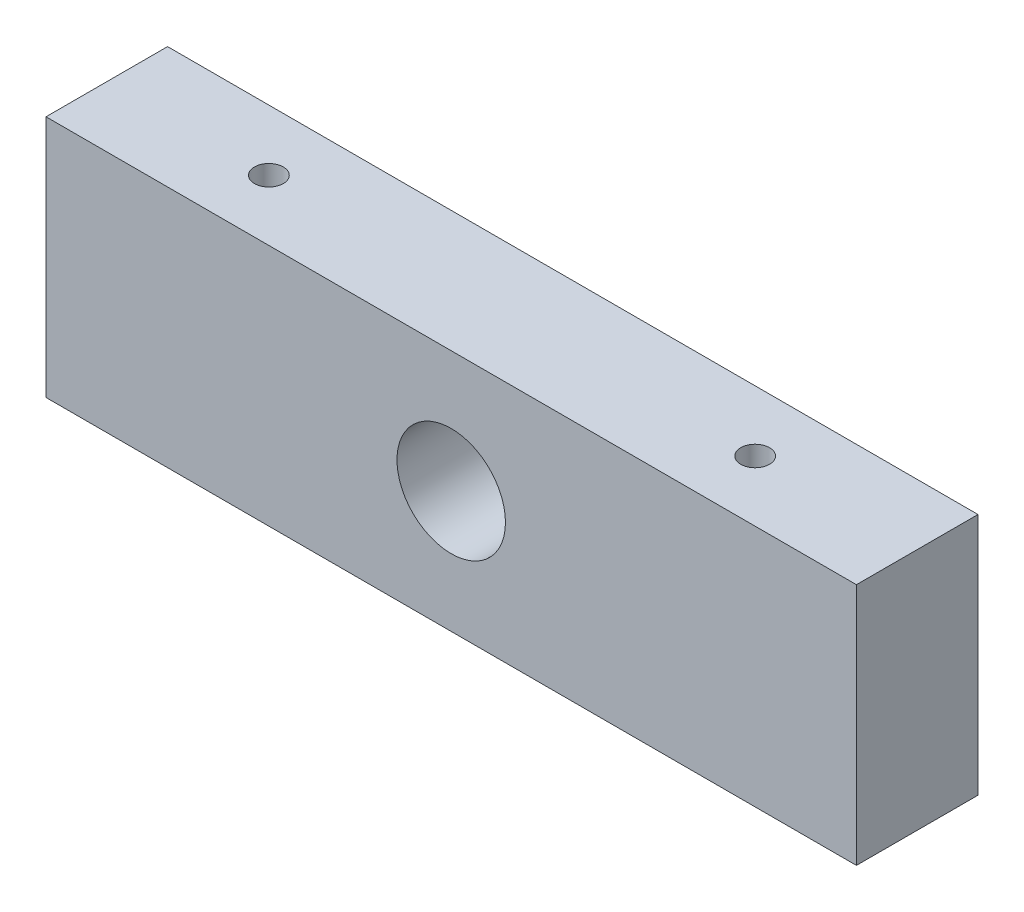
ISO-10303-21;
HEADER;
FILE_DESCRIPTION(('STEP AP214'),'2;1');
FILE_NAME('part.step','',(''),(''),'','','');
FILE_SCHEMA(('AUTOMOTIVE_DESIGN { 1 0 10303 214 1 1 1 1 }'));
ENDSEC;
DATA;
#1=APPLICATION_CONTEXT('core data for automotive mechanical design processes');
#2=APPLICATION_PROTOCOL_DEFINITION('international standard','automotive_design',2000,#1);
#3=PRODUCT_CONTEXT('',#1,'mechanical');
#4=PRODUCT('Part','Part','',(#3));
#5=PRODUCT_RELATED_PRODUCT_CATEGORY('part','',(#4));
#6=PRODUCT_DEFINITION_FORMATION('','',#4);
#7=PRODUCT_DEFINITION_CONTEXT('part definition',#1,'design');
#8=PRODUCT_DEFINITION('design','',#6,#7);
#9=PRODUCT_DEFINITION_SHAPE('','',#8);
#10=(LENGTH_UNIT() NAMED_UNIT(*) SI_UNIT(.MILLI.,.METRE.));
#11=(NAMED_UNIT(*) PLANE_ANGLE_UNIT() SI_UNIT($,.RADIAN.));
#12=(NAMED_UNIT(*) SI_UNIT($,.STERADIAN.) SOLID_ANGLE_UNIT());
#13=UNCERTAINTY_MEASURE_WITH_UNIT(LENGTH_MEASURE(1.E-05),#10,'distance_accuracy_value','');
#14=(GEOMETRIC_REPRESENTATION_CONTEXT(3) GLOBAL_UNCERTAINTY_ASSIGNED_CONTEXT((#13)) GLOBAL_UNIT_ASSIGNED_CONTEXT((#10,
#11,#12)) REPRESENTATION_CONTEXT('',''));
#15=CARTESIAN_POINT('',(0.,0.,0.));
#16=DIRECTION('',(0.,0.,1.));
#17=DIRECTION('',(1.,0.,0.));
#18=AXIS2_PLACEMENT_3D('',#15,#16,#17);
#19=CARTESIAN_POINT('',(0.,19.05,0.));
#20=DIRECTION('',(1.,0.,0.));
#21=DIRECTION('',(0.,0.,-1.));
#22=AXIS2_PLACEMENT_3D('',#19,#20,#21);
#23=PLANE('',#22);
#24=DIRECTION('',(0.,0.,1.));
#25=VECTOR('',#24,1.);
#26=CARTESIAN_POINT('',(0.,0.,0.));
#27=LINE('',#26,#25);
#28=CARTESIAN_POINT('',(0.,0.,-9.525));
#29=VERTEX_POINT('',#28);
#30=CARTESIAN_POINT('',(0.,0.,0.));
#31=VERTEX_POINT('',#30);
#32=EDGE_CURVE('E117',#29,#31,#27,.T.);
#33=ORIENTED_EDGE('',*,*,#32,.T.);
#34=DIRECTION('',(0.,-1.,0.));
#35=VECTOR('',#34,1.);
#36=CARTESIAN_POINT('',(0.,19.05,0.));
#37=LINE('',#36,#35);
#38=CARTESIAN_POINT('',(0.,19.05,0.));
#39=VERTEX_POINT('',#38);
#40=EDGE_CURVE('E11',#39,#31,#37,.T.);
#41=ORIENTED_EDGE('',*,*,#40,.F.);
#42=DIRECTION('',(0.,0.,1.));
#43=VECTOR('',#42,1.);
#44=CARTESIAN_POINT('',(0.,19.05,0.));
#45=LINE('',#44,#43);
#46=CARTESIAN_POINT('',(0.,19.05,-9.525));
#47=VERTEX_POINT('',#46);
#48=EDGE_CURVE('E101',#47,#39,#45,.T.);
#49=ORIENTED_EDGE('',*,*,#48,.F.);
#50=DIRECTION('',(0.,-1.,0.));
#51=VECTOR('',#50,1.);
#52=CARTESIAN_POINT('',(0.,19.05,-9.525));
#53=LINE('',#52,#51);
#54=EDGE_CURVE('E113',#47,#29,#53,.T.);
#55=ORIENTED_EDGE('',*,*,#54,.T.);
#56=EDGE_LOOP('',(#33,#41,#49,#55));
#57=FACE_BOUND('',#56,.T.);
#58=ADVANCED_FACE('F49',(#57),#23,.F.);
#59=CARTESIAN_POINT('',(0.,19.05,0.));
#60=DIRECTION('',(0.,0.,-1.));
#61=DIRECTION('',(-1.,0.,0.));
#62=AXIS2_PLACEMENT_3D('',#59,#60,#61);
#63=PLANE('',#62);
#64=CARTESIAN_POINT('',(31.75,9.525,0.));
#65=DIRECTION('',(0.,0.,1.));
#66=DIRECTION('',(1.,0.,0.));
#67=AXIS2_PLACEMENT_3D('',#64,#65,#66);
#68=CIRCLE('',#67,4.25);
#69=CARTESIAN_POINT('',(36.,9.525,0.));
#70=VERTEX_POINT('',#69);
#71=EDGE_CURVE('E141',#70,#70,#68,.T.);
#72=ORIENTED_EDGE('',*,*,#71,.F.);
#73=EDGE_LOOP('',(#72));
#74=FACE_BOUND('',#73,.T.);
#75=DIRECTION('',(1.,0.,0.));
#76=VECTOR('',#75,1.);
#77=CARTESIAN_POINT('',(0.,0.,0.));
#78=LINE('',#77,#76);
#79=CARTESIAN_POINT('',(63.5,0.,0.));
#80=VERTEX_POINT('',#79);
#81=EDGE_CURVE('E106',#31,#80,#78,.T.);
#82=ORIENTED_EDGE('',*,*,#81,.T.);
#83=DIRECTION('',(0.,-1.,0.));
#84=VECTOR('',#83,1.);
#85=CARTESIAN_POINT('',(63.5,19.05,0.));
#86=LINE('',#85,#84);
#87=CARTESIAN_POINT('',(63.5,19.05,0.));
#88=VERTEX_POINT('',#87);
#89=EDGE_CURVE('E58',#88,#80,#86,.T.);
#90=ORIENTED_EDGE('',*,*,#89,.F.);
#91=DIRECTION('',(1.,0.,0.));
#92=VECTOR('',#91,1.);
#93=CARTESIAN_POINT('',(0.,19.05,0.));
#94=LINE('',#93,#92);
#95=EDGE_CURVE('E96',#39,#88,#94,.T.);
#96=ORIENTED_EDGE('',*,*,#95,.F.);
#97=ORIENTED_EDGE('',*,*,#40,.T.);
#98=EDGE_LOOP('',(#82,#90,#96,#97));
#99=FACE_BOUND('',#98,.T.);
#100=ADVANCED_FACE('F105',(#74,#99),#63,.F.);
#101=CARTESIAN_POINT('',(63.5,19.05,0.));
#102=DIRECTION('',(-1.,0.,0.));
#103=DIRECTION('',(0.,0.,1.));
#104=AXIS2_PLACEMENT_3D('',#101,#102,#103);
#105=PLANE('',#104);
#106=DIRECTION('',(0.,0.,-1.));
#107=VECTOR('',#106,1.);
#108=CARTESIAN_POINT('',(63.5,0.,0.));
#109=LINE('',#108,#107);
#110=CARTESIAN_POINT('',(63.5,0.,-9.525));
#111=VERTEX_POINT('',#110);
#112=EDGE_CURVE('E83',#80,#111,#109,.T.);
#113=ORIENTED_EDGE('',*,*,#112,.T.);
#114=DIRECTION('',(0.,-1.,0.));
#115=VECTOR('',#114,1.);
#116=CARTESIAN_POINT('',(63.5,19.05,-9.525));
#117=LINE('',#116,#115);
#118=CARTESIAN_POINT('',(63.5,19.05,-9.525));
#119=VERTEX_POINT('',#118);
#120=EDGE_CURVE('E108',#119,#111,#117,.T.);
#121=ORIENTED_EDGE('',*,*,#120,.F.);
#122=DIRECTION('',(0.,0.,-1.));
#123=VECTOR('',#122,1.);
#124=CARTESIAN_POINT('',(63.5,19.05,0.));
#125=LINE('',#124,#123);
#126=EDGE_CURVE('E99',#88,#119,#125,.T.);
#127=ORIENTED_EDGE('',*,*,#126,.F.);
#128=ORIENTED_EDGE('',*,*,#89,.T.);
#129=EDGE_LOOP('',(#113,#121,#127,#128));
#130=FACE_BOUND('',#129,.T.);
#131=ADVANCED_FACE('F109',(#130),#105,.F.);
#132=CARTESIAN_POINT('',(0.,19.05,-9.525));
#133=DIRECTION('',(0.,0.,1.));
#134=DIRECTION('',(1.,0.,0.));
#135=AXIS2_PLACEMENT_3D('',#132,#133,#134);
#136=PLANE('',#135);
#137=CARTESIAN_POINT('',(31.75,9.525,-9.525));
#138=DIRECTION('',(0.,0.,1.));
#139=DIRECTION('',(1.,0.,0.));
#140=AXIS2_PLACEMENT_3D('',#137,#138,#139);
#141=CIRCLE('',#140,4.25);
#142=CARTESIAN_POINT('',(36.,9.525,-9.525));
#143=VERTEX_POINT('',#142);
#144=EDGE_CURVE('E121',#143,#143,#141,.T.);
#145=ORIENTED_EDGE('',*,*,#144,.T.);
#146=EDGE_LOOP('',(#145));
#147=FACE_BOUND('',#146,.T.);
#148=DIRECTION('',(-1.,0.,0.));
#149=VECTOR('',#148,1.);
#150=CARTESIAN_POINT('',(0.,0.,-9.525));
#151=LINE('',#150,#149);
#152=EDGE_CURVE('E89',#111,#29,#151,.T.);
#153=ORIENTED_EDGE('',*,*,#152,.T.);
#154=ORIENTED_EDGE('',*,*,#54,.F.);
#155=DIRECTION('',(-1.,0.,0.));
#156=VECTOR('',#155,1.);
#157=CARTESIAN_POINT('',(0.,19.05,-9.525));
#158=LINE('',#157,#156);
#159=EDGE_CURVE('E66',#119,#47,#158,.T.);
#160=ORIENTED_EDGE('',*,*,#159,.F.);
#161=ORIENTED_EDGE('',*,*,#120,.T.);
#162=EDGE_LOOP('',(#153,#154,#160,#161));
#163=FACE_BOUND('',#162,.T.);
#164=ADVANCED_FACE('F131',(#147,#163),#136,.F.);
#165=CARTESIAN_POINT('',(0.,19.05,0.));
#166=DIRECTION('',(0.,-1.,0.));
#167=DIRECTION('',(0.,0.,-1.));
#168=AXIS2_PLACEMENT_3D('',#165,#166,#167);
#169=PLANE('',#168);
#170=CARTESIAN_POINT('',(12.7,19.05,-4.7625));
#171=DIRECTION('',(0.,1.,0.));
#172=DIRECTION('',(0.,0.,1.));
#173=AXIS2_PLACEMENT_3D('',#170,#171,#172);
#174=CIRCLE('',#173,1.1303);
#175=CARTESIAN_POINT('',(12.7,19.05,-3.6322));
#176=VERTEX_POINT('',#175);
#177=EDGE_CURVE('E157',#176,#176,#174,.T.);
#178=ORIENTED_EDGE('',*,*,#177,.F.);
#179=EDGE_LOOP('',(#178));
#180=FACE_BOUND('',#179,.T.);
#181=CARTESIAN_POINT('',(50.8,19.05,-4.7625));
#182=DIRECTION('',(0.,1.,0.));
#183=DIRECTION('',(0.,0.,1.));
#184=AXIS2_PLACEMENT_3D('',#181,#182,#183);
#185=CIRCLE('',#184,1.1303);
#186=CARTESIAN_POINT('',(50.8,19.05,-3.6322));
#187=VERTEX_POINT('',#186);
#188=EDGE_CURVE('E149',#187,#187,#185,.T.);
#189=ORIENTED_EDGE('',*,*,#188,.F.);
#190=EDGE_LOOP('',(#189));
#191=FACE_BOUND('',#190,.T.);
#192=ORIENTED_EDGE('',*,*,#48,.T.);
#193=ORIENTED_EDGE('',*,*,#95,.T.);
#194=ORIENTED_EDGE('',*,*,#126,.T.);
#195=ORIENTED_EDGE('',*,*,#159,.T.);
#196=EDGE_LOOP('',(#192,#193,#194,#195));
#197=FACE_BOUND('',#196,.T.);
#198=ADVANCED_FACE('F97',(#180,#191,#197),#169,.F.);
#199=CARTESIAN_POINT('',(0.,0.,0.));
#200=DIRECTION('',(0.,-1.,0.));
#201=DIRECTION('',(0.,0.,-1.));
#202=AXIS2_PLACEMENT_3D('',#199,#200,#201);
#203=PLANE('',#202);
#204=CARTESIAN_POINT('',(12.7,0.,-4.7625));
#205=DIRECTION('',(0.,1.,0.));
#206=DIRECTION('',(0.,0.,1.));
#207=AXIS2_PLACEMENT_3D('',#204,#205,#206);
#208=CIRCLE('',#207,1.13029999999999);
#209=CARTESIAN_POINT('',(12.7,0.,-3.63220000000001));
#210=VERTEX_POINT('',#209);
#211=EDGE_CURVE('E153',#210,#210,#208,.T.);
#212=ORIENTED_EDGE('',*,*,#211,.T.);
#213=EDGE_LOOP('',(#212));
#214=FACE_BOUND('',#213,.T.);
#215=CARTESIAN_POINT('',(50.8,0.,-4.7625));
#216=DIRECTION('',(0.,1.,0.));
#217=DIRECTION('',(0.,0.,1.));
#218=AXIS2_PLACEMENT_3D('',#215,#216,#217);
#219=CIRCLE('',#218,1.13029999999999);
#220=CARTESIAN_POINT('',(50.8,0.,-3.63220000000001));
#221=VERTEX_POINT('',#220);
#222=EDGE_CURVE('E145',#221,#221,#219,.T.);
#223=ORIENTED_EDGE('',*,*,#222,.T.);
#224=EDGE_LOOP('',(#223));
#225=FACE_BOUND('',#224,.T.);
#226=ORIENTED_EDGE('',*,*,#32,.F.);
#227=ORIENTED_EDGE('',*,*,#152,.F.);
#228=ORIENTED_EDGE('',*,*,#112,.F.);
#229=ORIENTED_EDGE('',*,*,#81,.F.);
#230=EDGE_LOOP('',(#226,#227,#228,#229));
#231=FACE_BOUND('',#230,.T.);
#232=ADVANCED_FACE('F134',(#214,#225,#231),#203,.T.);
#233=CARTESIAN_POINT('',(31.75,9.525,0.));
#234=DIRECTION('',(0.,0.,1.));
#235=DIRECTION('',(1.,0.,0.));
#236=AXIS2_PLACEMENT_3D('',#233,#234,#235);
#237=CYLINDRICAL_SURFACE('',#236,4.25);
#238=ORIENTED_EDGE('',*,*,#144,.F.);
#239=EDGE_LOOP('',(#238));
#240=FACE_BOUND('',#239,.T.);
#241=ORIENTED_EDGE('',*,*,#71,.T.);
#242=EDGE_LOOP('',(#241));
#243=FACE_BOUND('',#242,.T.);
#244=ADVANCED_FACE('F171',(#240,#243),#237,.F.);
#245=CARTESIAN_POINT('',(50.8,19.05,-4.7625));
#246=DIRECTION('',(0.,1.,0.));
#247=DIRECTION('',(0.,0.,1.));
#248=AXIS2_PLACEMENT_3D('',#245,#246,#247);
#249=CYLINDRICAL_SURFACE('',#248,1.1303);
#250=ORIENTED_EDGE('',*,*,#222,.F.);
#251=EDGE_LOOP('',(#250));
#252=FACE_BOUND('',#251,.T.);
#253=ORIENTED_EDGE('',*,*,#188,.T.);
#254=EDGE_LOOP('',(#253));
#255=FACE_BOUND('',#254,.T.);
#256=ADVANCED_FACE('F169',(#252,#255),#249,.F.);
#257=CARTESIAN_POINT('',(12.7,19.05,-4.7625));
#258=DIRECTION('',(0.,1.,0.));
#259=DIRECTION('',(0.,0.,1.));
#260=AXIS2_PLACEMENT_3D('',#257,#258,#259);
#261=CYLINDRICAL_SURFACE('',#260,1.1303);
#262=ORIENTED_EDGE('',*,*,#211,.F.);
#263=EDGE_LOOP('',(#262));
#264=FACE_BOUND('',#263,.T.);
#265=ORIENTED_EDGE('',*,*,#177,.T.);
#266=EDGE_LOOP('',(#265));
#267=FACE_BOUND('',#266,.T.);
#268=ADVANCED_FACE('F162',(#264,#267),#261,.F.);
#269=CLOSED_SHELL('',(#58,#100,#131,#164,#198,#232,#244,#256,#268));
#270=MANIFOLD_SOLID_BREP('B2',#269);
#271=ADVANCED_BREP_SHAPE_REPRESENTATION('',(#18,#270),#14);
#272=SHAPE_DEFINITION_REPRESENTATION(#9,#271);
ENDSEC;
END-ISO-10303-21;
